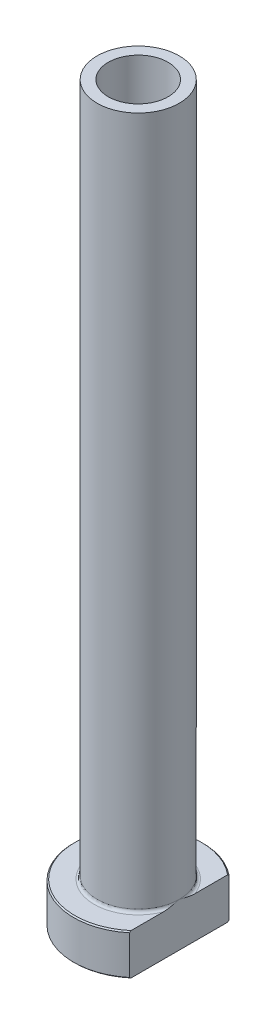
ISO-10303-21;
HEADER;
FILE_DESCRIPTION(('STEP AP214'),'2;1');
FILE_NAME('part.step','',(''),(''),'','','');
FILE_SCHEMA(('AUTOMOTIVE_DESIGN { 1 0 10303 214 1 1 1 1 }'));
ENDSEC;
DATA;
#1=APPLICATION_CONTEXT('core data for automotive mechanical design processes');
#2=APPLICATION_PROTOCOL_DEFINITION('international standard','automotive_design',2000,#1);
#3=PRODUCT_CONTEXT('',#1,'mechanical');
#4=PRODUCT('Part','Part','',(#3));
#5=PRODUCT_RELATED_PRODUCT_CATEGORY('part','',(#4));
#6=PRODUCT_DEFINITION_FORMATION('','',#4);
#7=PRODUCT_DEFINITION_CONTEXT('part definition',#1,'design');
#8=PRODUCT_DEFINITION('design','',#6,#7);
#9=PRODUCT_DEFINITION_SHAPE('','',#8);
#10=(LENGTH_UNIT() NAMED_UNIT(*) SI_UNIT(.MILLI.,.METRE.));
#11=(NAMED_UNIT(*) PLANE_ANGLE_UNIT() SI_UNIT($,.RADIAN.));
#12=(NAMED_UNIT(*) SI_UNIT($,.STERADIAN.) SOLID_ANGLE_UNIT());
#13=UNCERTAINTY_MEASURE_WITH_UNIT(LENGTH_MEASURE(1.E-05),#10,'distance_accuracy_value','');
#14=(GEOMETRIC_REPRESENTATION_CONTEXT(3) GLOBAL_UNCERTAINTY_ASSIGNED_CONTEXT((#13)) GLOBAL_UNIT_ASSIGNED_CONTEXT((#10,
#11,#12)) REPRESENTATION_CONTEXT('',''));
#15=CARTESIAN_POINT('',(0.,0.,0.));
#16=DIRECTION('',(0.,0.,1.));
#17=DIRECTION('',(1.,0.,0.));
#18=AXIS2_PLACEMENT_3D('',#15,#16,#17);
#19=CARTESIAN_POINT('',(0.,92.1876809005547,0.));
#20=DIRECTION('',(0.,1.,0.));
#21=DIRECTION('',(0.,0.,1.));
#22=AXIS2_PLACEMENT_3D('',#19,#20,#21);
#23=CYLINDRICAL_SURFACE('',#22,5.09999999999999);
#24=CARTESIAN_POINT('',(0.,125.,0.));
#25=DIRECTION('',(0.,1.,0.));
#26=DIRECTION('',(0.,0.,1.));
#27=AXIS2_PLACEMENT_3D('',#24,#25,#26);
#28=CIRCLE('',#27,5.09999999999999);
#29=CARTESIAN_POINT('',(0.,125.,5.09999999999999));
#30=VERTEX_POINT('',#29);
#31=EDGE_CURVE('E167',#30,#30,#28,.T.);
#32=ORIENTED_EDGE('',*,*,#31,.T.);
#33=EDGE_LOOP('',(#32));
#34=FACE_BOUND('',#33,.T.);
#35=CARTESIAN_POINT('',(0.,70.,0.));
#36=DIRECTION('',(0.,1.,0.));
#37=DIRECTION('',(0.,0.,1.));
#38=AXIS2_PLACEMENT_3D('',#35,#36,#37);
#39=CIRCLE('',#38,5.09999999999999);
#40=CARTESIAN_POINT('',(0.,70.,5.09999999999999));
#41=VERTEX_POINT('',#40);
#42=EDGE_CURVE('E170',#41,#41,#39,.T.);
#43=ORIENTED_EDGE('',*,*,#42,.F.);
#44=EDGE_LOOP('',(#43));
#45=FACE_BOUND('',#44,.T.);
#46=ADVANCED_FACE('F32',(#34,#45),#23,.F.);
#47=CARTESIAN_POINT('',(-5.09999999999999,125.,0.));
#48=DIRECTION('',(0.,1.,0.));
#49=DIRECTION('',(0.,0.,1.));
#50=AXIS2_PLACEMENT_3D('',#47,#48,#49);
#51=PLANE('',#50);
#52=CARTESIAN_POINT('',(0.,125.,0.));
#53=DIRECTION('',(0.,1.,0.));
#54=DIRECTION('',(0.,0.,1.));
#55=AXIS2_PLACEMENT_3D('',#52,#53,#54);
#56=CIRCLE('',#55,7.);
#57=CARTESIAN_POINT('',(0.,125.,7.));
#58=VERTEX_POINT('',#57);
#59=EDGE_CURVE('E174',#58,#58,#56,.T.);
#60=ORIENTED_EDGE('',*,*,#59,.T.);
#61=EDGE_LOOP('',(#60));
#62=FACE_BOUND('',#61,.T.);
#63=ORIENTED_EDGE('',*,*,#31,.F.);
#64=EDGE_LOOP('',(#63));
#65=FACE_BOUND('',#64,.T.);
#66=ADVANCED_FACE('F157',(#62,#65),#51,.T.);
#67=CARTESIAN_POINT('',(0.,92.1876809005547,0.));
#68=DIRECTION('',(0.,1.,0.));
#69=DIRECTION('',(0.,0.,1.));
#70=AXIS2_PLACEMENT_3D('',#67,#68,#69);
#71=CYLINDRICAL_SURFACE('',#70,7.);
#72=CARTESIAN_POINT('',(0.,7.50000000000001,0.));
#73=DIRECTION('',(0.,1.,0.));
#74=DIRECTION('',(0.,0.,1.));
#75=AXIS2_PLACEMENT_3D('',#72,#73,#74);
#76=CIRCLE('',#75,7.);
#77=CARTESIAN_POINT('',(7.,7.50000000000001,0.));
#78=VERTEX_POINT('',#77);
#79=EDGE_CURVE('E180',#78,#78,#76,.T.);
#80=ORIENTED_EDGE('',*,*,#79,.T.);
#81=EDGE_LOOP('',(#80));
#82=FACE_BOUND('',#81,.T.);
#83=ORIENTED_EDGE('',*,*,#59,.F.);
#84=EDGE_LOOP('',(#83));
#85=FACE_BOUND('',#84,.T.);
#86=ADVANCED_FACE('F162',(#82,#85),#71,.T.);
#87=CARTESIAN_POINT('',(-6.99999999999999,7.,0.));
#88=DIRECTION('',(0.,1.,0.));
#89=DIRECTION('',(0.,0.,1.));
#90=AXIS2_PLACEMENT_3D('',#87,#88,#89);
#91=PLANE('',#90);
#92=DIRECTION('',(0.,0.,1.));
#93=VECTOR('',#92,1.);
#94=CARTESIAN_POINT('',(6.99999999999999,7.,0.));
#95=LINE('',#94,#93);
#96=CARTESIAN_POINT('',(7.,7.,-8.22435407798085));
#97=VERTEX_POINT('',#96);
#98=CARTESIAN_POINT('',(6.99999999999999,7.,-2.69258240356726));
#99=VERTEX_POINT('',#98);
#100=EDGE_CURVE('E54',#97,#99,#95,.T.);
#101=ORIENTED_EDGE('',*,*,#100,.F.);
#102=CARTESIAN_POINT('',(0.,7.,0.));
#103=DIRECTION('',(0.,1.,0.));
#104=DIRECTION('',(0.,0.,1.));
#105=AXIS2_PLACEMENT_3D('',#102,#103,#104);
#106=CIRCLE('',#105,10.8);
#107=CARTESIAN_POINT('',(6.99999999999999,7.,8.22435407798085));
#108=VERTEX_POINT('',#107);
#109=EDGE_CURVE('E186',#97,#108,#106,.T.);
#110=ORIENTED_EDGE('',*,*,#109,.T.);
#111=CARTESIAN_POINT('',(6.99999999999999,7.,2.69258240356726));
#112=VERTEX_POINT('',#111);
#113=EDGE_CURVE('E134',#112,#108,#95,.T.);
#114=ORIENTED_EDGE('',*,*,#113,.F.);
#115=CARTESIAN_POINT('',(0.,7.,0.));
#116=DIRECTION('',(0.,1.,0.));
#117=DIRECTION('',(0.,0.,1.));
#118=AXIS2_PLACEMENT_3D('',#115,#116,#117);
#119=CIRCLE('',#118,7.5);
#120=EDGE_CURVE('E183',#112,#99,#119,.F.);
#121=ORIENTED_EDGE('',*,*,#120,.T.);
#122=EDGE_LOOP('',(#101,#110,#114,#121));
#123=FACE_BOUND('',#122,.T.);
#124=ADVANCED_FACE('F197',(#123),#91,.T.);
#125=CARTESIAN_POINT('',(0.,92.1876809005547,0.));
#126=DIRECTION('',(0.,1.,0.));
#127=DIRECTION('',(0.,0.,1.));
#128=AXIS2_PLACEMENT_3D('',#125,#126,#127);
#129=CYLINDRICAL_SURFACE('',#128,11.);
#130=DIRECTION('',(0.,-1.,0.));
#131=VECTOR('',#130,1.);
#132=CARTESIAN_POINT('',(6.99999999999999,125.,8.48528137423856));
#133=LINE('',#132,#131);
#134=CARTESIAN_POINT('',(6.99999999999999,6.80000000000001,8.48528137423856));
#135=VERTEX_POINT('',#134);
#136=CARTESIAN_POINT('',(6.99999999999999,0.200000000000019,8.48528137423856));
#137=VERTEX_POINT('',#136);
#138=EDGE_CURVE('E82',#135,#137,#133,.T.);
#139=ORIENTED_EDGE('',*,*,#138,.F.);
#140=CARTESIAN_POINT('',(0.,6.80000000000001,0.));
#141=DIRECTION('',(0.,1.,0.));
#142=DIRECTION('',(0.,0.,1.));
#143=AXIS2_PLACEMENT_3D('',#140,#141,#142);
#144=CIRCLE('',#143,11.);
#145=CARTESIAN_POINT('',(7.,6.80000000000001,-8.48528137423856));
#146=VERTEX_POINT('',#145);
#147=EDGE_CURVE('E95',#135,#146,#144,.F.);
#148=ORIENTED_EDGE('',*,*,#147,.T.);
#149=DIRECTION('',(0.,-1.,0.));
#150=VECTOR('',#149,1.);
#151=CARTESIAN_POINT('',(7.,125.,-8.48528137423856));
#152=LINE('',#151,#150);
#153=CARTESIAN_POINT('',(7.,0.20000000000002,-8.48528137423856));
#154=VERTEX_POINT('',#153);
#155=EDGE_CURVE('E192',#146,#154,#152,.T.);
#156=ORIENTED_EDGE('',*,*,#155,.T.);
#157=CARTESIAN_POINT('',(0.,0.20000000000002,0.));
#158=DIRECTION('',(0.,-1.,0.));
#159=DIRECTION('',(0.,0.,-1.));
#160=AXIS2_PLACEMENT_3D('',#157,#158,#159);
#161=CIRCLE('',#160,11.);
#162=EDGE_CURVE('E98',#154,#137,#161,.F.);
#163=ORIENTED_EDGE('',*,*,#162,.T.);
#164=EDGE_LOOP('',(#139,#148,#156,#163));
#165=FACE_BOUND('',#164,.T.);
#166=ADVANCED_FACE('F190',(#165),#129,.T.);
#167=CARTESIAN_POINT('',(-11.,0.,0.));
#168=DIRECTION('',(0.,-1.,0.));
#169=DIRECTION('',(0.,0.,-1.));
#170=AXIS2_PLACEMENT_3D('',#167,#168,#169);
#171=PLANE('',#170);
#172=CARTESIAN_POINT('',(0.,0.,0.));
#173=DIRECTION('',(0.,-1.,0.));
#174=DIRECTION('',(0.,0.,-1.));
#175=AXIS2_PLACEMENT_3D('',#172,#173,#174);
#176=CIRCLE('',#175,5.84999999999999);
#177=CARTESIAN_POINT('',(0.,0.,-5.84999999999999));
#178=VERTEX_POINT('',#177);
#179=EDGE_CURVE('E40',#178,#178,#176,.F.);
#180=ORIENTED_EDGE('',*,*,#179,.T.);
#181=EDGE_LOOP('',(#180));
#182=FACE_BOUND('',#181,.T.);
#183=DIRECTION('',(0.,0.,-1.));
#184=VECTOR('',#183,1.);
#185=CARTESIAN_POINT('',(6.99999999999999,0.,8.48528137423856));
#186=LINE('',#185,#184);
#187=CARTESIAN_POINT('',(6.99999999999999,0.,8.22435407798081));
#188=VERTEX_POINT('',#187);
#189=CARTESIAN_POINT('',(7.,0.,-8.22435407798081));
#190=VERTEX_POINT('',#189);
#191=EDGE_CURVE('E47',#188,#190,#186,.T.);
#192=ORIENTED_EDGE('',*,*,#191,.F.);
#193=CARTESIAN_POINT('',(0.,0.,0.));
#194=DIRECTION('',(0.,-1.,0.));
#195=DIRECTION('',(0.,0.,-1.));
#196=AXIS2_PLACEMENT_3D('',#193,#194,#195);
#197=CIRCLE('',#196,10.8);
#198=EDGE_CURVE('E92',#188,#190,#197,.T.);
#199=ORIENTED_EDGE('',*,*,#198,.T.);
#200=EDGE_LOOP('',(#192,#199));
#201=FACE_BOUND('',#200,.T.);
#202=ADVANCED_FACE('F91',(#182,#201),#171,.T.);
#203=CARTESIAN_POINT('',(0.,92.1876809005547,0.));
#204=DIRECTION('',(0.,1.,0.));
#205=DIRECTION('',(0.,0.,1.));
#206=AXIS2_PLACEMENT_3D('',#203,#204,#205);
#207=CYLINDRICAL_SURFACE('',#206,5.34999999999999);
#208=CARTESIAN_POINT('',(0.,0.5,0.));
#209=DIRECTION('',(0.,-1.,0.));
#210=DIRECTION('',(0.,0.,-1.));
#211=AXIS2_PLACEMENT_3D('',#208,#209,#210);
#212=CIRCLE('',#211,5.34999999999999);
#213=CARTESIAN_POINT('',(0.,0.5,-5.34999999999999));
#214=VERTEX_POINT('',#213);
#215=EDGE_CURVE('E11',#214,#214,#212,.T.);
#216=ORIENTED_EDGE('',*,*,#215,.T.);
#217=EDGE_LOOP('',(#216));
#218=FACE_BOUND('',#217,.T.);
#219=CARTESIAN_POINT('',(0.,58.,0.));
#220=DIRECTION('',(0.,1.,0.));
#221=DIRECTION('',(0.,0.,1.));
#222=AXIS2_PLACEMENT_3D('',#219,#220,#221);
#223=CIRCLE('',#222,5.35);
#224=CARTESIAN_POINT('',(0.,58.,5.35));
#225=VERTEX_POINT('',#224);
#226=EDGE_CURVE('E172',#225,#225,#223,.T.);
#227=ORIENTED_EDGE('',*,*,#226,.T.);
#228=EDGE_LOOP('',(#227));
#229=FACE_BOUND('',#228,.T.);
#230=ADVANCED_FACE('F215',(#218,#229),#207,.F.);
#231=CARTESIAN_POINT('',(0.,58.,0.));
#232=DIRECTION('',(0.,-1.,0.));
#233=DIRECTION('',(0.,0.,-1.));
#234=AXIS2_PLACEMENT_3D('',#231,#232,#233);
#235=CONICAL_SURFACE('',#234,5.35,0.0208303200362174);
#236=ORIENTED_EDGE('',*,*,#42,.T.);
#237=EDGE_LOOP('',(#236));
#238=FACE_BOUND('',#237,.T.);
#239=ORIENTED_EDGE('',*,*,#226,.F.);
#240=EDGE_LOOP('',(#239));
#241=FACE_BOUND('',#240,.T.);
#242=ADVANCED_FACE('F111',(#238,#241),#235,.F.);
#243=CARTESIAN_POINT('',(0.,7.50000000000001,0.));
#244=DIRECTION('',(0.,1.,0.));
#245=DIRECTION('',(0.,0.,1.));
#246=AXIS2_PLACEMENT_3D('',#243,#244,#245);
#247=TOROIDAL_SURFACE('',#246,7.5,0.5);
#248=ORIENTED_EDGE('',*,*,#120,.F.);
#249=CARTESIAN_POINT('',(7.,7.50000000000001,0.));
#250=CARTESIAN_POINT('',(7.,7.50000080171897,-1.25553870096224E-10));
#251=CARTESIAN_POINT('',(7.,7.50000160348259,2.90220272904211E-07));
#252=CARTESIAN_POINT('',(7.,7.50000310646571,1.10846441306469E-06));
#253=CARTESIAN_POINT('',(7.,7.50000379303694,1.65470112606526E-06));
#254=CARTESIAN_POINT('',(7.,7.50000521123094,2.96102753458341E-06));
#255=CARTESIAN_POINT('',(7.,7.50000592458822,3.7420417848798E-06));
#256=CARTESIAN_POINT('',(7.,7.50000721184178,5.36891875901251E-06));
#257=CARTESIAN_POINT('',(7.,7.50000778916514,6.21226347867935E-06));
#258=CARTESIAN_POINT('',(7.,7.50000990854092,9.4488970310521E-06));
#259=CARTESIAN_POINT('',(7.,7.50001133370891,1.19224913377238E-05));
#260=CARTESIAN_POINT('',(7.,7.50001370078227,1.68453048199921E-05));
#261=CARTESIAN_POINT('',(7.,7.50001467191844,1.92810862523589E-05));
#262=CARTESIAN_POINT('',(7.,7.50001870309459,2.95057524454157E-05));
#263=CARTESIAN_POINT('',(7.,7.50002167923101,3.73333819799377E-05));
#264=CARTESIAN_POINT('',(7.,7.50002610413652,5.21820411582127E-05));
#265=CARTESIAN_POINT('',(7.,7.50002771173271,5.91556013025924E-05));
#266=CARTESIAN_POINT('',(7.,7.50003935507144,0.000110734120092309));
#267=CARTESIAN_POINT('',(7.,7.50004810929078,0.000155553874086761));
#268=CARTESIAN_POINT('',(7.,7.50008643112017,0.000332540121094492));
#269=CARTESIAN_POINT('',(7.,7.50012307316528,0.000463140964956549));
#270=CARTESIAN_POINT('',(7.,7.50026565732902,0.000980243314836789));
#271=CARTESIAN_POINT('',(7.,7.50036696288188,0.00136762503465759));
#272=CARTESIAN_POINT('',(7.,7.50077257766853,0.00290683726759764));
#273=CARTESIAN_POINT('',(7.,7.50108269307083,0.00405753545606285));
#274=CARTESIAN_POINT('',(7.,7.50237341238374,0.0088598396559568));
#275=CARTESIAN_POINT('',(7.,7.50334676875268,0.0125128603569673));
#276=CARTESIAN_POINT('',(7.,7.51627189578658,0.061003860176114));
#277=CARTESIAN_POINT('',(7.,7.52827280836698,0.105832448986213));
#278=CARTESIAN_POINT('',(7.,7.55170994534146,0.193693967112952));
#279=CARTESIAN_POINT('',(7.,7.56314936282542,0.236726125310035));
#280=CARTESIAN_POINT('',(7.,7.5874041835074,0.328321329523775));
#281=CARTESIAN_POINT('',(7.,7.60020832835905,0.376887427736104));
#282=CARTESIAN_POINT('',(7.,7.62578161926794,0.474605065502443));
#283=CARTESIAN_POINT('',(7.,7.63854879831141,0.523757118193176));
#284=CARTESIAN_POINT('',(7.,7.66904753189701,0.642366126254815));
#285=CARTESIAN_POINT('',(7.,7.6866596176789,0.711854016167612));
#286=CARTESIAN_POINT('',(7.,7.72074501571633,0.849103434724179));
#287=CARTESIAN_POINT('',(7.,7.73723627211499,0.916860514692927));
#288=CARTESIAN_POINT('',(7.,7.79038156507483,1.14104210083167));
#289=CARTESIAN_POINT('',(7.,7.82528973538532,1.29788860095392));
#290=CARTESIAN_POINT('',(7.,7.88862298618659,1.61471917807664));
#291=CARTESIAN_POINT('',(7.,7.91697354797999,1.77471883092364));
#292=CARTESIAN_POINT('',(7.,7.95258292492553,2.02253505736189));
#293=CARTESIAN_POINT('',(7.,7.96355251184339,2.10981398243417));
#294=CARTESIAN_POINT('',(7.,7.98165287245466,2.28476193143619));
#295=CARTESIAN_POINT('',(7.,7.98878459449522,2.37243085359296));
#296=CARTESIAN_POINT('',(7.,7.99822919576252,2.54760327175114));
#297=CARTESIAN_POINT('',(7.,8.00056589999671,2.63510541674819));
#298=CARTESIAN_POINT('',(7.,7.99919996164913,2.81004074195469));
#299=CARTESIAN_POINT('',(7.,7.99550272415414,2.89747391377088));
#300=CARTESIAN_POINT('',(7.,7.98391011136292,3.0288207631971));
#301=CARTESIAN_POINT('',(7.,7.97897237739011,3.07299684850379));
#302=CARTESIAN_POINT('',(7.,7.96665453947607,3.16105400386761));
#303=CARTESIAN_POINT('',(7.,7.95927246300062,3.20493480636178));
#304=CARTESIAN_POINT('',(7.,7.94168688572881,3.29163191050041));
#305=CARTESIAN_POINT('',(7.,7.93151559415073,3.33445462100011));
#306=CARTESIAN_POINT('',(7.,7.90768392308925,3.41909658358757));
#307=CARTESIAN_POINT('',(7.,7.89402748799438,3.46091691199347));
#308=CARTESIAN_POINT('',(7.,7.86214701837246,3.54331777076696));
#309=CARTESIAN_POINT('',(7.,7.84387618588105,3.58388050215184));
#310=CARTESIAN_POINT('',(7.,7.80145892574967,3.66184445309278));
#311=CARTESIAN_POINT('',(7.,7.7773356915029,3.69925738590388));
#312=CARTESIAN_POINT('',(7.,7.73714014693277,3.74836513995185));
#313=CARTESIAN_POINT('',(7.,7.72423208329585,3.7626369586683));
#314=CARTESIAN_POINT('',(7.,7.69673765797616,3.78951670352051));
#315=CARTESIAN_POINT('',(7.,7.68215013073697,3.80212346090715));
#316=CARTESIAN_POINT('',(7.,7.65099843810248,3.82514624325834));
#317=CARTESIAN_POINT('',(7.,7.63441049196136,3.83553078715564));
#318=CARTESIAN_POINT('',(7.,7.5995579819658,3.85294010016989));
#319=CARTESIAN_POINT('',(7.,7.58129885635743,3.85997533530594));
#320=CARTESIAN_POINT('',(7.,7.54906837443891,3.86837810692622));
#321=CARTESIAN_POINT('',(7.,7.53536870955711,3.8707923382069));
#322=CARTESIAN_POINT('',(7.,7.50775756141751,3.87325240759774));
#323=CARTESIAN_POINT('',(7.,7.49384618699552,3.87329942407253));
#324=CARTESIAN_POINT('',(7.,7.46623771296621,3.87102093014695));
#325=CARTESIAN_POINT('',(7.,7.45254041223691,3.8686978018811));
#326=CARTESIAN_POINT('',(7.,7.42569741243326,3.86188775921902));
#327=CARTESIAN_POINT('',(7.,7.41255212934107,3.85739924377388));
#328=CARTESIAN_POINT('',(7.,7.38259319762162,3.84468786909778));
#329=CARTESIAN_POINT('',(7.,7.3661021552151,3.83570823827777));
#330=CARTESIAN_POINT('',(7.,7.33476729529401,3.81523202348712));
#331=CARTESIAN_POINT('',(7.,7.31992737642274,3.80372966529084));
#332=CARTESIAN_POINT('',(7.,7.28371925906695,3.77170797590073));
#333=CARTESIAN_POINT('',(7.,7.26356272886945,3.74983059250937));
#334=CARTESIAN_POINT('',(7.,7.22671696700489,3.70338283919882));
#335=CARTESIAN_POINT('',(7.,7.21003361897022,3.67880800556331));
#336=CARTESIAN_POINT('',(7.,7.1802655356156,3.62921731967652));
#337=CARTESIAN_POINT('',(7.,7.16704475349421,3.60428175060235));
#338=CARTESIAN_POINT('',(7.,7.14275069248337,3.55337478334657));
#339=CARTESIAN_POINT('',(7.,7.13167947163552,3.52740242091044));
#340=CARTESIAN_POINT('',(7.,7.10104499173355,3.44809573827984));
#341=CARTESIAN_POINT('',(7.,7.08424174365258,3.39369851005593));
#342=CARTESIAN_POINT('',(7.,7.05431378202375,3.27667221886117));
#343=CARTESIAN_POINT('',(7.,7.0419171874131,3.21386807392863));
#344=CARTESIAN_POINT('',(7.,7.0223460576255,3.08735184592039));
#345=CARTESIAN_POINT('',(7.,7.01518234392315,3.02363815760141));
#346=CARTESIAN_POINT('',(7.,7.00517826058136,2.89779001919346));
#347=CARTESIAN_POINT('',(7.,7.00221627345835,2.83566460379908));
#348=CARTESIAN_POINT('',(7.,6.99952325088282,2.7116062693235));
#349=CARTESIAN_POINT('',(7.,6.99977918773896,2.6496735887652));
#350=CARTESIAN_POINT('',(7.,7.00377761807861,2.49407814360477));
#351=CARTESIAN_POINT('',(7.,7.00924384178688,2.40046113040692));
#352=CARTESIAN_POINT('',(7.,7.0249410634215,2.21367396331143));
#353=CARTESIAN_POINT('',(7.,7.03517106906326,2.12050372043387));
#354=CARTESIAN_POINT('',(7.,7.05969765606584,1.93249035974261));
#355=CARTESIAN_POINT('',(7.,7.07408383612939,1.8376591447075));
#356=CARTESIAN_POINT('',(7.,7.10603300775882,1.6482934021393));
#357=CARTESIAN_POINT('',(7.,7.12360402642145,1.55376025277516));
#358=CARTESIAN_POINT('',(7.,7.16806468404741,1.33086107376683));
#359=CARTESIAN_POINT('',(7.,7.1960178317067,1.20270896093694));
#360=CARTESIAN_POINT('',(7.,7.25475947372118,0.948586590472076));
#361=CARTESIAN_POINT('',(7.,7.28551257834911,0.82260799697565));
#362=CARTESIAN_POINT('',(7.,7.33123897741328,0.641334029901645));
#363=CARTESIAN_POINT('',(7.,7.34543722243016,0.58584061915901));
#364=CARTESIAN_POINT('',(7.,7.37418243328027,0.474686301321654));
#365=CARTESIAN_POINT('',(7.,7.38873064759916,0.419025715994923));
#366=CARTESIAN_POINT('',(7.,7.41873357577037,0.305011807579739));
#367=CARTESIAN_POINT('',(7.,7.43419762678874,0.246660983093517));
#368=CARTESIAN_POINT('',(7.,7.46502361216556,0.130933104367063));
#369=CARTESIAN_POINT('',(7.,7.48038319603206,0.0735554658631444));
#370=CARTESIAN_POINT('',(7.,7.49665455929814,0.0125077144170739));
#371=CARTESIAN_POINT('',(7.,7.49762931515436,0.00884956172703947));
#372=CARTESIAN_POINT('',(7.,7.49892036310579,0.0040460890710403));
#373=CARTESIAN_POINT('',(7.,7.49922940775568,0.00289935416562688));
#374=CARTESIAN_POINT('',(7.,7.49963371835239,0.00136508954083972));
#375=CARTESIAN_POINT('',(7.,7.499734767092,0.000978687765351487));
#376=CARTESIAN_POINT('',(7.,7.49987704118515,0.00046273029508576));
#377=CARTESIAN_POINT('',(7.,7.49991363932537,0.000332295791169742));
#378=CARTESIAN_POINT('',(7.,7.49995192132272,0.000155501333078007));
#379=CARTESIAN_POINT('',(7.,7.49996067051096,0.000110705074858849));
#380=CARTESIAN_POINT('',(7.,7.49997230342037,5.91504855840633E-05));
#381=CARTESIAN_POINT('',(7.,7.49997390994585,5.21782459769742E-05));
#382=CARTESIAN_POINT('',(7.,7.4999783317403,3.73322807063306E-05));
#383=CARTESIAN_POINT('',(7.,7.4999813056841,2.95059544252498E-05));
#384=CARTESIAN_POINT('',(7.,7.49998533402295,1.92826350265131E-05));
#385=CARTESIAN_POINT('',(7.,7.49998630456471,1.68469523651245E-05));
#386=CARTESIAN_POINT('',(7.,7.49998867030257,1.19242372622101E-05));
#387=CARTESIAN_POINT('',(7.,7.49999009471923,9.45063049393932E-06));
#388=CARTESIAN_POINT('',(7.,7.49999221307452,6.21386443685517E-06));
#389=CARTESIAN_POINT('',(7.,7.49999279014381,5.37045304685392E-06));
#390=CARTESIAN_POINT('',(7.,7.49999407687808,3.74339687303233E-06));
#391=CARTESIAN_POINT('',(7.,7.49999478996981,2.96226854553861E-06));
#392=CARTESIAN_POINT('',(7.,7.49999620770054,1.65567341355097E-06));
#393=CARTESIAN_POINT('',(7.,7.49999689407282,1.10929189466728E-06));
#394=CARTESIAN_POINT('',(7.,7.49999839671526,2.9068315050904E-07));
#395=CARTESIAN_POINT('',(7.,7.49999919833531,1.25546802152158E-10));
#396=CARTESIAN_POINT('',(7.,7.50000000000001,0.));
#397=B_SPLINE_CURVE_WITH_KNOTS('',3,(#249,#250,#251,#252,#253,#254,#255,#256,#257,#258,#259,
#260,#261,#262,#263,#264,#265,#266,#267,#268,#269,#270,#271,#272,#273,#274,#275,#276,#277,#278,
#279,#280,#281,#282,#283,#284,#285,#286,#287,#288,#289,#290,#291,#292,#293,#294,#295,#296,#297,
#298,#299,#300,#301,#302,#303,#304,#305,#306,#307,#308,#309,#310,#311,#312,#313,#314,#315,#316,
#317,#318,#319,#320,#321,#322,#323,#324,#325,#326,#327,#328,#329,#330,#331,#332,#333,#334,#335,
#336,#337,#338,#339,#340,#341,#342,#343,#344,#345,#346,#347,#348,#349,#350,#351,#352,#353,#354,
#355,#356,#357,#358,#359,#360,#361,#362,#363,#364,#365,#366,#367,#368,#369,#370,#371,#372,#373,
#374,#375,#376,#377,#378,#379,#380,#381,#382,#383,#384,#385,#386,#387,#388,#389,#390,#391,#392,
#393,#394,#395,#396),.UNSPECIFIED.,.T.,.F.,(4,2,2,2,2,2,2,2,2,2,2,2,2,2,2,2,2,2,2,2,2,2,2,2,2,2,
2,2,2,2,2,2,2,2,2,2,2,2,2,2,2,2,2,2,2,2,2,2,2,2,2,2,2,2,2,2,2,2,2,2,2,2,2,2,2,2,2,2,2,2,2,2,2,
4),(0.,2.42201439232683E-06,5.0530489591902E-06,8.20814149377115E-06,1.12722937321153E-05,
1.98044023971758E-05,2.76642073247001E-05,5.27403854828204E-05,7.41830797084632E-05,
0.000211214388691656,0.000617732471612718,0.00181938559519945,0.00539412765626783,
0.0167361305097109,0.155952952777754,0.289534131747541,0.440210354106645,0.592559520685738,
0.80761174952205,1.01681499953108,1.49878389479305,1.98598665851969,2.24981935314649,
2.51358682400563,2.77604050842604,3.03825922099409,3.17156039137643,3.30496939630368,
3.43689837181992,3.56867869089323,3.70185328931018,3.83450849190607,3.89212877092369,
3.94978928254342,4.00821928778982,4.06646549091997,4.10801107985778,4.14953598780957,
4.19101920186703,4.23253313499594,4.28854866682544,4.34469377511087,4.43343413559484,
4.52232362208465,4.60686785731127,4.69149264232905,4.86185145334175,5.05362927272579,
5.24580256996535,5.43229132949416,5.6180253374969,5.89918385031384,6.18028382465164,
6.46796485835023,6.75638131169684,7.14981284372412,7.53882346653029,7.71066604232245,
7.88325629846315,8.06435328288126,8.24254095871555,8.25389891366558,8.25746134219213,
8.25865995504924,8.25906595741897,8.25920291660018,8.2592243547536,8.25924942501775,
8.25925728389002,8.25926581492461,8.25926887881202,8.25927203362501,8.25927466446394,
8.25927708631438),.UNSPECIFIED.);
#398=EDGE_CURVE('E126',#112,#78,#397,.T.);
#399=ORIENTED_EDGE('',*,*,#398,.T.);
#400=ORIENTED_EDGE('',*,*,#79,.F.);
#401=CARTESIAN_POINT('',(7.,7.50000000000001,0.));
#402=CARTESIAN_POINT('',(7.,7.49999919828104,1.25555284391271E-10));
#403=CARTESIAN_POINT('',(7.,7.49999839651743,-2.90220271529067E-07));
#404=CARTESIAN_POINT('',(7.,7.4999968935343,-1.10846441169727E-06));
#405=CARTESIAN_POINT('',(7.,7.49999620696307,-1.65470112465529E-06));
#406=CARTESIAN_POINT('',(7.,7.49999478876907,-2.96102753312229E-06));
#407=CARTESIAN_POINT('',(7.,7.49999407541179,-3.74204178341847E-06));
#408=CARTESIAN_POINT('',(7.,7.49999278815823,-5.36891875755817E-06));
#409=CARTESIAN_POINT('',(7.,7.49999221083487,-6.21226347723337E-06));
#410=CARTESIAN_POINT('',(7.,7.49999009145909,-9.44889702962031E-06));
#411=CARTESIAN_POINT('',(7.,7.49998866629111,-1.19224913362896E-05));
#412=CARTESIAN_POINT('',(7.,7.49998629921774,-1.68453048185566E-05));
#413=CARTESIAN_POINT('',(7.,7.49998532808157,-1.92810862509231E-05));
#414=CARTESIAN_POINT('',(7.,7.49998129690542,-2.95057524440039E-05));
#415=CARTESIAN_POINT('',(6.99999999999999,7.499978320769,-3.73333819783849E-05));
#416=CARTESIAN_POINT('',(6.99999999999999,7.49997389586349,-5.21820411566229E-05));
#417=CARTESIAN_POINT('',(6.99999999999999,7.49997228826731,-5.91556013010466E-05));
#418=CARTESIAN_POINT('',(7.,7.49996064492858,-0.000110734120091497));
#419=CARTESIAN_POINT('',(7.,7.49995189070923,-0.000155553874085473));
#420=CARTESIAN_POINT('',(6.99999999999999,7.49991356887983,-0.000332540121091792));
#421=CARTESIAN_POINT('',(6.99999999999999,7.49987692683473,-0.000463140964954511));
#422=CARTESIAN_POINT('',(7.,7.499734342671,-0.000980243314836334));
#423=CARTESIAN_POINT('',(7.,7.49963303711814,-0.00136762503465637));
#424=CARTESIAN_POINT('',(6.99999999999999,7.49922742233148,-0.00290683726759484));
#425=CARTESIAN_POINT('',(6.99999999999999,7.49891730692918,-0.00405753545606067));
#426=CARTESIAN_POINT('',(7.00000000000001,7.49762658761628,-0.00885983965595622));
#427=CARTESIAN_POINT('',(7.,7.49665323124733,-0.0125128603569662));
#428=CARTESIAN_POINT('',(6.99999999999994,7.48372810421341,-0.0610038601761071));
#429=CARTESIAN_POINT('',(6.99999999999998,7.47172719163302,-0.10583244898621));
#430=CARTESIAN_POINT('',(7.00000000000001,7.44829005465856,-0.193693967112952));
#431=CARTESIAN_POINT('',(7.,7.43685063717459,-0.236726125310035));
#432=CARTESIAN_POINT('',(6.99999999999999,7.41259581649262,-0.328321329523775));
#433=CARTESIAN_POINT('',(6.99999999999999,7.39979167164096,-0.376887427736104));
#434=CARTESIAN_POINT('',(7.,7.37421838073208,-0.474605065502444));
#435=CARTESIAN_POINT('',(7.,7.36145120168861,-0.523757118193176));
#436=CARTESIAN_POINT('',(6.99999999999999,7.330952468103,-0.642366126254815));
#437=CARTESIAN_POINT('',(7.,7.31334038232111,-0.711854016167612));
#438=CARTESIAN_POINT('',(7.,7.27925498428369,-0.849103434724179));
#439=CARTESIAN_POINT('',(7.,7.26276372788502,-0.916860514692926));
#440=CARTESIAN_POINT('',(7.,7.20961843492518,-1.14104210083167));
#441=CARTESIAN_POINT('',(7.,7.17471026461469,-1.29788860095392));
#442=CARTESIAN_POINT('',(7.,7.11137701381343,-1.61471917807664));
#443=CARTESIAN_POINT('',(7.,7.08302645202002,-1.77471883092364));
#444=CARTESIAN_POINT('',(7.,7.04741707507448,-2.02253505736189));
#445=CARTESIAN_POINT('',(7.,7.03644748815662,-2.10981398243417));
#446=CARTESIAN_POINT('',(7.,7.01834712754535,-2.28476193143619));
#447=CARTESIAN_POINT('',(7.,7.01121540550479,-2.37243085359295));
#448=CARTESIAN_POINT('',(7.,7.0017708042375,-2.54760327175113));
#449=CARTESIAN_POINT('',(7.,6.99943410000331,-2.63510541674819));
#450=CARTESIAN_POINT('',(7.,7.00080003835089,-2.81004074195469));
#451=CARTESIAN_POINT('',(7.,7.00449727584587,-2.89747391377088));
#452=CARTESIAN_POINT('',(7.,7.0160898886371,-3.0288207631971));
#453=CARTESIAN_POINT('',(7.,7.0210276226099,-3.07299684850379));
#454=CARTESIAN_POINT('',(7.,7.03334546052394,-3.16105400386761));
#455=CARTESIAN_POINT('',(7.,7.0407275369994,-3.20493480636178));
#456=CARTESIAN_POINT('',(7.,7.0583131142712,-3.29163191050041));
#457=CARTESIAN_POINT('',(7.,7.06848440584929,-3.33445462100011));
#458=CARTESIAN_POINT('',(7.,7.09231607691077,-3.41909658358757));
#459=CARTESIAN_POINT('',(7.,7.10597251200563,-3.46091691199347));
#460=CARTESIAN_POINT('',(7.,7.13785298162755,-3.54331777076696));
#461=CARTESIAN_POINT('',(7.,7.15612381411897,-3.58388050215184));
#462=CARTESIAN_POINT('',(7.,7.19854107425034,-3.66184445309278));
#463=CARTESIAN_POINT('',(7.,7.22266430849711,-3.69925738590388));
#464=CARTESIAN_POINT('',(7.,7.26285985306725,-3.74836513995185));
#465=CARTESIAN_POINT('',(7.,7.27576791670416,-3.76263695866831));
#466=CARTESIAN_POINT('',(7.,7.30326234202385,-3.78951670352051));
#467=CARTESIAN_POINT('',(7.,7.31784986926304,-3.80212346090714));
#468=CARTESIAN_POINT('',(7.,7.34900156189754,-3.82514624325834));
#469=CARTESIAN_POINT('',(7.,7.36558950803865,-3.83553078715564));
#470=CARTESIAN_POINT('',(7.,7.40044201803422,-3.85294010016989));
#471=CARTESIAN_POINT('',(7.,7.41870114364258,-3.85997533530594));
#472=CARTESIAN_POINT('',(7.,7.45093162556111,-3.86837810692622));
#473=CARTESIAN_POINT('',(7.,7.4646312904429,-3.8707923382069));
#474=CARTESIAN_POINT('',(7.,7.49224243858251,-3.87325240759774));
#475=CARTESIAN_POINT('',(7.,7.5061538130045,-3.87329942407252));
#476=CARTESIAN_POINT('',(7.,7.5337622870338,-3.87102093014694));
#477=CARTESIAN_POINT('',(7.,7.5474595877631,-3.8686978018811));
#478=CARTESIAN_POINT('',(7.,7.57430258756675,-3.86188775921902));
#479=CARTESIAN_POINT('',(7.,7.58744787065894,-3.85739924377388));
#480=CARTESIAN_POINT('',(7.,7.61740680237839,-3.84468786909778));
#481=CARTESIAN_POINT('',(7.,7.63389784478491,-3.83570823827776));
#482=CARTESIAN_POINT('',(7.,7.665232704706,-3.81523202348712));
#483=CARTESIAN_POINT('',(7.,7.68007262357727,-3.80372966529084));
#484=CARTESIAN_POINT('',(7.,7.71628074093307,-3.77170797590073));
#485=CARTESIAN_POINT('',(7.,7.73643727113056,-3.74983059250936));
#486=CARTESIAN_POINT('',(7.,7.77328303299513,-3.70338283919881));
#487=CARTESIAN_POINT('',(7.,7.78996638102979,-3.67880800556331));
#488=CARTESIAN_POINT('',(7.,7.81973446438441,-3.62921731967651));
#489=CARTESIAN_POINT('',(7.,7.8329552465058,-3.60428175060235));
#490=CARTESIAN_POINT('',(7.,7.85724930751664,-3.55337478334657));
#491=CARTESIAN_POINT('',(7.,7.86832052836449,-3.52740242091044));
#492=CARTESIAN_POINT('',(7.,7.89895500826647,-3.44809573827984));
#493=CARTESIAN_POINT('',(7.,7.91575825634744,-3.39369851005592));
#494=CARTESIAN_POINT('',(7.,7.94568621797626,-3.27667221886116));
#495=CARTESIAN_POINT('',(7.,7.95808281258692,-3.21386807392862));
#496=CARTESIAN_POINT('',(7.,7.97765394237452,-3.08735184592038));
#497=CARTESIAN_POINT('',(7.,7.98481765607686,-3.0236381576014));
#498=CARTESIAN_POINT('',(7.,7.99482173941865,-2.89779001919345));
#499=CARTESIAN_POINT('',(7.,7.99778372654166,-2.83566460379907));
#500=CARTESIAN_POINT('',(7.,8.00047674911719,-2.71160626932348));
#501=CARTESIAN_POINT('',(7.,8.00022081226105,-2.64967358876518));
#502=CARTESIAN_POINT('',(7.,7.9962223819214,-2.49407814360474));
#503=CARTESIAN_POINT('',(7.,7.99075615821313,-2.4004611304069));
#504=CARTESIAN_POINT('',(7.,7.97505893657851,-2.21367396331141));
#505=CARTESIAN_POINT('',(7.,7.96482893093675,-2.12050372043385));
#506=CARTESIAN_POINT('',(7.,7.94030234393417,-1.93249035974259));
#507=CARTESIAN_POINT('',(7.,7.92591616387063,-1.83765914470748));
#508=CARTESIAN_POINT('',(7.,7.89396699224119,-1.64829340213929));
#509=CARTESIAN_POINT('',(7.,7.87639597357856,-1.55376025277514));
#510=CARTESIAN_POINT('',(7.,7.83193531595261,-1.33086107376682));
#511=CARTESIAN_POINT('',(7.,7.80398216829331,-1.20270896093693));
#512=CARTESIAN_POINT('',(7.,7.74524052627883,-0.94858659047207));
#513=CARTESIAN_POINT('',(7.,7.71448742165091,-0.822607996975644));
#514=CARTESIAN_POINT('',(7.,7.66876102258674,-0.641334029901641));
#515=CARTESIAN_POINT('',(7.,7.65456277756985,-0.585840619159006));
#516=CARTESIAN_POINT('',(7.,7.62581756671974,-0.474686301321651));
#517=CARTESIAN_POINT('',(7.,7.61126935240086,-0.41902571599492));
#518=CARTESIAN_POINT('',(7.,7.58126642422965,-0.305011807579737));
#519=CARTESIAN_POINT('',(7.,7.56580237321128,-0.246660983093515));
#520=CARTESIAN_POINT('',(7.,7.53497638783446,-0.130933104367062));
#521=CARTESIAN_POINT('',(7.,7.51961680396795,-0.0735554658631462));
#522=CARTESIAN_POINT('',(7.,7.50334544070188,-0.0125077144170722));
#523=CARTESIAN_POINT('',(7.,7.50237068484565,-0.00884956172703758));
#524=CARTESIAN_POINT('',(7.,7.50107963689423,-0.00404608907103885));
#525=CARTESIAN_POINT('',(7.,7.50077059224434,-0.00289935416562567));
#526=CARTESIAN_POINT('',(7.,7.50036628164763,-0.0013650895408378));
#527=CARTESIAN_POINT('',(7.,7.50026523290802,-0.000978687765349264));
#528=CARTESIAN_POINT('',(7.,7.50012295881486,-0.000462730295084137));
#529=CARTESIAN_POINT('',(7.,7.50008636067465,-0.000332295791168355));
#530=CARTESIAN_POINT('',(7.,7.50004807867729,-0.000155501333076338));
#531=CARTESIAN_POINT('',(7.,7.50003932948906,-0.000110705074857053));
#532=CARTESIAN_POINT('',(7.,7.50002769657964,-5.91504855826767E-05));
#533=CARTESIAN_POINT('',(7.,7.50002609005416,-5.2178245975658E-05));
#534=CARTESIAN_POINT('',(7.,7.50002166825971,-3.7332280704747E-05));
#535=CARTESIAN_POINT('',(7.,7.50001869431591,-2.95059544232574E-05));
#536=CARTESIAN_POINT('',(7.,7.50001466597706,-1.92826350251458E-05));
#537=CARTESIAN_POINT('',(7.,7.5000136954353,-1.68469523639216E-05));
#538=CARTESIAN_POINT('',(7.,7.50001132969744,-1.1924237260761E-05));
#539=CARTESIAN_POINT('',(7.,7.50000990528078,-9.45063049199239E-06));
#540=CARTESIAN_POINT('',(7.,7.50000778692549,-6.21386443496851E-06));
#541=CARTESIAN_POINT('',(7.,7.5000072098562,-5.37045304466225E-06));
#542=CARTESIAN_POINT('',(7.,7.50000592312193,-3.74339687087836E-06));
#543=CARTESIAN_POINT('',(6.99999999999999,7.5000052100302,-2.96226854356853E-06));
#544=CARTESIAN_POINT('',(7.,7.50000379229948,-1.65567341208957E-06));
#545=CARTESIAN_POINT('',(7.,7.50000310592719,-1.10929189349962E-06));
#546=CARTESIAN_POINT('',(7.,7.50000160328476,-2.90683149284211E-07));
#547=CARTESIAN_POINT('',(7.,7.5000008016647,-1.25545354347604E-10));
#548=CARTESIAN_POINT('',(7.,7.50000000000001,0.));
#549=B_SPLINE_CURVE_WITH_KNOTS('',3,(#401,#402,#403,#404,#405,#406,#407,#408,#409,#410,#411,
#412,#413,#414,#415,#416,#417,#418,#419,#420,#421,#422,#423,#424,#425,#426,#427,#428,#429,#430,
#431,#432,#433,#434,#435,#436,#437,#438,#439,#440,#441,#442,#443,#444,#445,#446,#447,#448,#449,
#450,#451,#452,#453,#454,#455,#456,#457,#458,#459,#460,#461,#462,#463,#464,#465,#466,#467,#468,
#469,#470,#471,#472,#473,#474,#475,#476,#477,#478,#479,#480,#481,#482,#483,#484,#485,#486,#487,
#488,#489,#490,#491,#492,#493,#494,#495,#496,#497,#498,#499,#500,#501,#502,#503,#504,#505,#506,
#507,#508,#509,#510,#511,#512,#513,#514,#515,#516,#517,#518,#519,#520,#521,#522,#523,#524,#525,
#526,#527,#528,#529,#530,#531,#532,#533,#534,#535,#536,#537,#538,#539,#540,#541,#542,#543,#544,
#545,#546,#547,#548),.UNSPECIFIED.,.T.,.F.,(4,2,2,2,2,2,2,2,2,2,2,2,2,2,2,2,2,2,2,2,2,2,2,2,2,2,
2,2,2,2,2,2,2,2,2,2,2,2,2,2,2,2,2,2,2,2,2,2,2,2,2,2,2,2,2,2,2,2,2,2,2,2,2,2,2,2,2,2,2,2,2,2,2,
4),(0.,2.42201439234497E-06,5.05304895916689E-06,8.20814149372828E-06,1.12722937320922E-05,
1.98044023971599E-05,2.76642073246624E-05,5.27403854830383E-05,7.41830797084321E-05,
0.000211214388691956,0.000617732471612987,0.00181938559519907,0.00539412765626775,
0.0167361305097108,0.155952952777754,0.289534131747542,0.440210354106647,0.59255952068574,
0.807611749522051,1.01681499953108,1.49878389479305,1.98598665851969,2.24981935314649,
2.51358682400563,2.77604050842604,3.0382592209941,3.17156039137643,3.30496939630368,
3.43689837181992,3.56867869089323,3.70185328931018,3.83450849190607,3.89212877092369,
3.94978928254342,4.00821928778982,4.06646549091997,4.10801107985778,4.14953598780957,
4.19101920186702,4.23253313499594,4.28854866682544,4.34469377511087,4.43343413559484,
4.52232362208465,4.60686785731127,4.69149264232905,4.86185145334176,5.0536292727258,
5.24580256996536,5.43229132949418,5.61802533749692,5.89918385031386,6.18028382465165,
6.46796485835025,6.75638131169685,7.14981284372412,7.5388234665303,7.71066604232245,
7.88325629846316,8.06435328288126,8.24254095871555,8.25389891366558,8.25746134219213,
8.25865995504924,8.25906595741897,8.25920291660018,8.2592243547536,8.25924942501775,
8.25925728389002,8.25926581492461,8.25926887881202,8.25927203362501,8.25927466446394,
8.25927708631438),.UNSPECIFIED.);
#550=EDGE_CURVE('E135',#78,#99,#549,.T.);
#551=ORIENTED_EDGE('',*,*,#550,.T.);
#552=EDGE_LOOP('',(#248,#399,#400,#551));
#553=FACE_BOUND('',#552,.T.);
#554=ADVANCED_FACE('F141',(#553),#247,.F.);
#555=CARTESIAN_POINT('',(0.,7.00000000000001,0.));
#556=DIRECTION('',(0.,-1.,0.));
#557=DIRECTION('',(0.,0.,-1.));
#558=AXIS2_PLACEMENT_3D('',#555,#556,#557);
#559=CONICAL_SURFACE('',#558,10.8,0.785398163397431);
#560=CARTESIAN_POINT('',(7.,-2.13774979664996,-18.6685261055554));
#561=CARTESIAN_POINT('',(7.,-1.86574872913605,-18.3780244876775));
#562=CARTESIAN_POINT('',(7.,-1.59415659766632,-18.0871392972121));
#563=CARTESIAN_POINT('',(7.,-1.0519287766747,-17.5044755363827));
#564=CARTESIAN_POINT('',(7.,-0.781293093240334,-17.2126969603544));
#565=CARTESIAN_POINT('',(7.,-0.241050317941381,-16.628048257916));
#566=CARTESIAN_POINT('',(7.,0.0285564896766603,-16.3351778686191));
#567=CARTESIAN_POINT('',(7.,0.566485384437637,-15.7482616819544));
#568=CARTESIAN_POINT('',(7.,0.834807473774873,-15.4542158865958));
#569=CARTESIAN_POINT('',(7.,1.64198377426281,-14.5651645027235));
#570=CARTESIAN_POINT('',(7.,2.17856420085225,-13.9680841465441));
#571=CARTESIAN_POINT('',(7.,2.97696333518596,-13.0668144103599));
#572=CARTESIAN_POINT('',(7.,3.24199785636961,-12.7654727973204));
#573=CARTESIAN_POINT('',(7.,3.76945856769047,-12.1605141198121));
#574=CARTESIAN_POINT('',(7.,4.03188476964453,-11.856897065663));
#575=CARTESIAN_POINT('',(7.,4.50733797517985,-11.3009625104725));
#576=CARTESIAN_POINT('',(7.,4.72088020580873,-11.0490858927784));
#577=CARTESIAN_POINT('',(7.,5.14538078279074,-10.5431655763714));
#578=CARTESIAN_POINT('',(7.,5.3563391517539,-10.2891218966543));
#579=CARTESIAN_POINT('',(7.,5.77522964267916,-9.77836737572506));
#580=CARTESIAN_POINT('',(7.,5.98316044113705,-9.5216554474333));
#581=CARTESIAN_POINT('',(7.,6.39521098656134,-9.00519084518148));
#582=CARTESIAN_POINT('',(7.,6.59933078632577,-8.74543821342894));
#583=CARTESIAN_POINT('',(7.,7.00243445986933,-8.22283607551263));
#584=CARTESIAN_POINT('',(7.,7.20142819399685,-7.95999419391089));
#585=CARTESIAN_POINT('',(7.,7.59353840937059,-7.42991856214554));
#586=CARTESIAN_POINT('',(7.,7.78665447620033,-7.16268450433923));
#587=CARTESIAN_POINT('',(7.,8.16523718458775,-6.62311113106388));
#588=CARTESIAN_POINT('',(7.,8.3507091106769,-6.35077553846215));
#589=CARTESIAN_POINT('',(7.,8.71189725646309,-5.79973731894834));
#590=CARTESIAN_POINT('',(7.,8.88761537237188,-5.52103594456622));
#591=CARTESIAN_POINT('',(7.,9.19554959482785,-5.00707921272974));
#592=CARTESIAN_POINT('',(7.,9.32988075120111,-4.77309669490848));
#593=CARTESIAN_POINT('',(7.,9.58764253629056,-4.29911523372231));
#594=CARTESIAN_POINT('',(7.,9.71107181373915,-4.05911554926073));
#595=CARTESIAN_POINT('',(7.,9.94390907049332,-3.57263619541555));
#596=CARTESIAN_POINT('',(7.,10.0533307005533,-3.32616312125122));
#597=CARTESIAN_POINT('',(7.,10.2545146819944,-2.82607166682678));
#598=CARTESIAN_POINT('',(7.,10.3462820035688,-2.57245532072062));
#599=CARTESIAN_POINT('',(7.,10.4907049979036,-2.11254447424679));
#600=CARTESIAN_POINT('',(7.,10.5475277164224,-1.90756611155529));
#601=CARTESIAN_POINT('',(7.,10.6452043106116,-1.49381161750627));
#602=CARTESIAN_POINT('',(7.,10.68606033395,-1.28503600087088));
#603=CARTESIAN_POINT('',(7.,10.749755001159,-0.865342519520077));
#604=CARTESIAN_POINT('',(7.,10.772646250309,-0.654432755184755));
#605=CARTESIAN_POINT('',(7.,10.7993569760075,-0.231396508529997));
#606=CARTESIAN_POINT('',(7.,10.8031771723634,-0.0192700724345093));
#607=CARTESIAN_POINT('',(7.,10.791517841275,0.404715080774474));
#608=CARTESIAN_POINT('',(7.,10.7760135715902,0.616573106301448));
#609=CARTESIAN_POINT('',(7.,10.726541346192,1.03810446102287));
#610=CARTESIAN_POINT('',(7.,10.692571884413,1.24777761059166));
#611=CARTESIAN_POINT('',(7.,10.6077703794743,1.66430273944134));
#612=CARTESIAN_POINT('',(7.,10.5568873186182,1.87114418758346));
#613=CARTESIAN_POINT('',(7.,10.4404729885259,2.2806127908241));
#614=CARTESIAN_POINT('',(7.,10.3749414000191,2.48323985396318));
#615=CARTESIAN_POINT('',(7.,10.2190980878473,2.91860265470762));
#616=CARTESIAN_POINT('',(7.,10.126461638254,3.15050038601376));
#617=CARTESIAN_POINT('',(7.,9.92740958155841,3.6083545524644));
#618=CARTESIAN_POINT('',(7.,9.82098769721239,3.83430822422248));
#619=CARTESIAN_POINT('',(7.,9.59695142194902,4.28105341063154));
#620=CARTESIAN_POINT('',(6.99999999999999,9.47931762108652,4.50183511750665));
#621=CARTESIAN_POINT('',(6.99999999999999,9.23524231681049,4.93840249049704));
#622=CARTESIAN_POINT('',(6.99999999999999,9.10880204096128,5.15418884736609));
#623=CARTESIAN_POINT('',(6.99999999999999,8.84714657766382,5.58417945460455));
#624=CARTESIAN_POINT('',(6.99999999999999,8.71183920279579,5.798327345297));
#625=CARTESIAN_POINT('',(6.99999999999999,8.43533082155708,6.22277635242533));
#626=CARTESIAN_POINT('',(6.99999999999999,8.29412966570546,6.43307737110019));
#627=CARTESIAN_POINT('',(6.99999999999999,8.00706556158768,6.85014007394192));
#628=CARTESIAN_POINT('',(6.99999999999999,7.86120763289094,7.05690522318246));
#629=CARTESIAN_POINT('',(6.99999999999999,7.56553131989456,7.46757278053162));
#630=CARTESIAN_POINT('',(6.99999999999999,7.41571298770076,7.67147522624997));
#631=CARTESIAN_POINT('',(6.99999999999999,7.07999705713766,8.12067189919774));
#632=CARTESIAN_POINT('',(6.99999999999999,6.89330819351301,8.3653740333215));
#633=CARTESIAN_POINT('',(6.99999999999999,6.5159718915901,8.85171196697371));
#634=CARTESIAN_POINT('',(6.99999999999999,6.32532432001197,9.09334766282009));
#635=CARTESIAN_POINT('',(6.99999999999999,5.94076020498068,9.57404667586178));
#636=CARTESIAN_POINT('',(6.99999999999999,5.74684327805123,9.81310968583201));
#637=CARTESIAN_POINT('',(6.99999999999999,5.35630729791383,10.2890203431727));
#638=CARTESIAN_POINT('',(6.99999999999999,5.15968820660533,10.5258679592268));
#639=CARTESIAN_POINT('',(6.99999999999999,4.56606953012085,11.2340330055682));
#640=CARTESIAN_POINT('',(6.99999999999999,4.1656814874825,11.7025100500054));
#641=CARTESIAN_POINT('',(6.99999999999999,3.35840033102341,12.6338245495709));
#642=CARTESIAN_POINT('',(6.99999999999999,2.95150704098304,13.0966618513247));
#643=CARTESIAN_POINT('',(6.99999999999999,2.35017562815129,13.773410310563));
#644=CARTESIAN_POINT('',(6.99999999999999,2.15763812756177,13.9890143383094));
#645=CARTESIAN_POINT('',(6.99999999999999,1.77161609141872,14.4193671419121));
#646=CARTESIAN_POINT('',(6.99999999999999,1.57813157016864,14.6341159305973));
#647=CARTESIAN_POINT('',(6.99999999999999,0.996412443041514,15.2772388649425));
#648=CARTESIAN_POINT('',(6.99999999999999,0.606922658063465,15.7044779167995));
#649=CARTESIAN_POINT('',(6.99999999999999,-0.173895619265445,16.5556520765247));
#650=CARTESIAN_POINT('',(6.99999999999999,-0.565218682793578,16.9795921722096));
#651=CARTESIAN_POINT('',(6.99999999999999,-1.34999931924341,17.8254589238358));
#652=CARTESIAN_POINT('',(6.99999999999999,-1.74345679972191,18.2473856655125));
#653=CARTESIAN_POINT('',(6.99999999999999,-2.13774979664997,18.6685261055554));
#654=B_SPLINE_CURVE_WITH_KNOTS('',3,(#560,#561,#562,#563,#564,#565,#566,#567,#568,#569,#570,
#571,#572,#573,#574,#575,#576,#577,#578,#579,#580,#581,#582,#583,#584,#585,#586,#587,#588,#589,
#590,#591,#592,#593,#594,#595,#596,#597,#598,#599,#600,#601,#602,#603,#604,#605,#606,#607,#608,
#609,#610,#611,#612,#613,#614,#615,#616,#617,#618,#619,#620,#621,#622,#623,#624,#625,#626,#627,
#628,#629,#630,#631,#632,#633,#634,#635,#636,#637,#638,#639,#640,#641,#642,#643,#644,#645,#646,
#647,#648,#649,#650,#651,#652,#653),.UNSPECIFIED.,.F.,.F.,(4,2,2,2,2,2,2,2,2,2,2,2,2,2,2,2,2,2,
2,2,2,2,2,2,2,2,2,2,2,2,2,2,2,2,2,2,2,2,2,2,2,2,2,2,2,2,4),(0.,1.19389386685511,
2.38779531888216,3.58200567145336,4.77621398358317,7.18442154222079,8.38834194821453,
9.59225689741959,10.5828886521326,11.5735117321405,12.5645555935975,13.5555857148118,
14.5445404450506,15.5335647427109,16.5218934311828,17.5100293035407,18.3192088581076,
19.1284885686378,19.9369735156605,20.745230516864,21.3828127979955,22.020309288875,
22.6559319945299,23.2915307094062,23.9279440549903,24.5644093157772,25.2028120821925,
25.8412287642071,26.5898097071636,27.3387327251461,28.0889766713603,28.8391162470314,
29.5989369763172,30.3587769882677,31.1178239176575,31.8768608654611,32.800165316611,
33.7235009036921,34.6469455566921,35.5704032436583,37.4191008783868,39.2678486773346,
40.1350269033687,41.0021920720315,42.7365692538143,44.467379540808,46.1981154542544),.UNSPECIFIED.);
#655=EDGE_CURVE('E133',#146,#97,#654,.T.);
#656=ORIENTED_EDGE('',*,*,#655,.F.);
#657=ORIENTED_EDGE('',*,*,#147,.F.);
#658=EDGE_CURVE('E118',#108,#135,#654,.T.);
#659=ORIENTED_EDGE('',*,*,#658,.F.);
#660=ORIENTED_EDGE('',*,*,#109,.F.);
#661=EDGE_LOOP('',(#656,#657,#659,#660));
#662=FACE_BOUND('',#661,.T.);
#663=ADVANCED_FACE('F145',(#662),#559,.T.);
#664=CARTESIAN_POINT('',(0.,0.20000000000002,0.));
#665=DIRECTION('',(0.,1.,0.));
#666=DIRECTION('',(0.,0.,1.));
#667=AXIS2_PLACEMENT_3D('',#664,#665,#666);
#668=CONICAL_SURFACE('',#667,11.,0.785398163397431);
#669=CARTESIAN_POINT('',(6.99999999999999,9.13774979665,18.6685261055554));
#670=CARTESIAN_POINT('',(6.99999999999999,8.86574872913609,18.3780244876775));
#671=CARTESIAN_POINT('',(6.99999999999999,8.59415659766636,18.0871392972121));
#672=CARTESIAN_POINT('',(6.99999999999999,8.05192877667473,17.5044755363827));
#673=CARTESIAN_POINT('',(6.99999999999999,7.78129309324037,17.2126969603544));
#674=CARTESIAN_POINT('',(6.99999999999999,7.24105031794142,16.628048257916));
#675=CARTESIAN_POINT('',(6.99999999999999,6.97144351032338,16.3351778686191));
#676=CARTESIAN_POINT('',(6.99999999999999,6.4335146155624,15.7482616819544));
#677=CARTESIAN_POINT('',(6.99999999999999,6.16519252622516,15.4542158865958));
#678=CARTESIAN_POINT('',(6.99999999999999,5.35801622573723,14.5651645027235));
#679=CARTESIAN_POINT('',(6.99999999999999,4.82143579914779,13.9680841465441));
#680=CARTESIAN_POINT('',(6.99999999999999,4.02303666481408,13.0668144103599));
#681=CARTESIAN_POINT('',(6.99999999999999,3.75800214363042,12.7654727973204));
#682=CARTESIAN_POINT('',(6.99999999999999,3.23054143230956,12.1605141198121));
#683=CARTESIAN_POINT('',(6.99999999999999,2.96811523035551,11.856897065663));
#684=CARTESIAN_POINT('',(6.99999999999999,2.49266202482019,11.3009625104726));
#685=CARTESIAN_POINT('',(6.99999999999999,2.27911979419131,11.0490858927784));
#686=CARTESIAN_POINT('',(6.99999999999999,1.8546192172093,10.5431655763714));
#687=CARTESIAN_POINT('',(6.99999999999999,1.64366084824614,10.2891218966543));
#688=CARTESIAN_POINT('',(6.99999999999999,1.22477035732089,9.77836737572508));
#689=CARTESIAN_POINT('',(6.99999999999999,1.016839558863,9.52165544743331));
#690=CARTESIAN_POINT('',(6.99999999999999,0.604789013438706,9.0051908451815));
#691=CARTESIAN_POINT('',(6.99999999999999,0.400669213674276,8.74543821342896));
#692=CARTESIAN_POINT('',(6.99999999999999,-0.00243445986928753,8.22283607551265));
#693=CARTESIAN_POINT('',(6.99999999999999,-0.201428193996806,7.95999419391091));
#694=CARTESIAN_POINT('',(6.99999999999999,-0.593538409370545,7.42991856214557));
#695=CARTESIAN_POINT('',(6.99999999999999,-0.786654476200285,7.16268450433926));
#696=CARTESIAN_POINT('',(6.99999999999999,-1.1652371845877,6.6231111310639));
#697=CARTESIAN_POINT('',(6.99999999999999,-1.35070911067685,6.35077553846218));
#698=CARTESIAN_POINT('',(6.99999999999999,-1.71189725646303,5.79973731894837));
#699=CARTESIAN_POINT('',(6.99999999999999,-1.88761537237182,5.52103594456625));
#700=CARTESIAN_POINT('',(6.99999999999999,-2.19554959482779,5.00707921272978));
#701=CARTESIAN_POINT('',(6.99999999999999,-2.32988075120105,4.77309669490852));
#702=CARTESIAN_POINT('',(6.99999999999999,-2.58764253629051,4.29911523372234));
#703=CARTESIAN_POINT('',(7.,-2.7110718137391,4.05911554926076));
#704=CARTESIAN_POINT('',(7.,-2.94390907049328,3.57263619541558));
#705=CARTESIAN_POINT('',(7.,-3.05333070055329,3.32616312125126));
#706=CARTESIAN_POINT('',(7.,-3.25451468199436,2.82607166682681));
#707=CARTESIAN_POINT('',(7.,-3.34628200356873,2.57245532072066));
#708=CARTESIAN_POINT('',(7.,-3.49070499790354,2.11254447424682));
#709=CARTESIAN_POINT('',(7.,-3.54752771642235,1.90756611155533));
#710=CARTESIAN_POINT('',(7.,-3.64520431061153,1.4938116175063));
#711=CARTESIAN_POINT('',(7.,-3.68606033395,1.28503600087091));
#712=CARTESIAN_POINT('',(7.,-3.74975500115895,0.865342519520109));
#713=CARTESIAN_POINT('',(7.,-3.77264625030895,0.654432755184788));
#714=CARTESIAN_POINT('',(7.,-3.79935697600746,0.23139650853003));
#715=CARTESIAN_POINT('',(7.,-3.8031771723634,0.0192700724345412));
#716=CARTESIAN_POINT('',(7.,-3.79151784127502,-0.404715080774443));
#717=CARTESIAN_POINT('',(7.,-3.77601357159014,-0.616573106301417));
#718=CARTESIAN_POINT('',(7.,-3.72654134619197,-1.03810446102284));
#719=CARTESIAN_POINT('',(7.,-3.69257188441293,-1.24777761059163));
#720=CARTESIAN_POINT('',(7.,-3.60777037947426,-1.66430273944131));
#721=CARTESIAN_POINT('',(7.,-3.5568873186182,-1.87114418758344));
#722=CARTESIAN_POINT('',(7.,-3.44047298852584,-2.28061279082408));
#723=CARTESIAN_POINT('',(7.,-3.37494140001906,-2.48323985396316));
#724=CARTESIAN_POINT('',(7.,-3.21909808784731,-2.9186026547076));
#725=CARTESIAN_POINT('',(7.,-3.12646163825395,-3.15050038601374));
#726=CARTESIAN_POINT('',(7.,-2.92740958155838,-3.60835455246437));
#727=CARTESIAN_POINT('',(7.,-2.82098769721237,-3.83430822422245));
#728=CARTESIAN_POINT('',(7.,-2.59695142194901,-4.2810534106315));
#729=CARTESIAN_POINT('',(7.,-2.4793176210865,-4.50183511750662));
#730=CARTESIAN_POINT('',(7.,-2.23524231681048,-4.938402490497));
#731=CARTESIAN_POINT('',(7.,-2.10880204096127,-5.15418884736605));
#732=CARTESIAN_POINT('',(7.,-1.84714657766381,-5.5841794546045));
#733=CARTESIAN_POINT('',(7.,-1.71183920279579,-5.79832734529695));
#734=CARTESIAN_POINT('',(7.,-1.43533082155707,-6.22277635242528));
#735=CARTESIAN_POINT('',(7.,-1.29412966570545,-6.43307737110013));
#736=CARTESIAN_POINT('',(7.,-1.00706556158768,-6.85014007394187));
#737=CARTESIAN_POINT('',(7.,-0.86120763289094,-7.05690522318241));
#738=CARTESIAN_POINT('',(7.,-0.565531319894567,-7.46757278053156));
#739=CARTESIAN_POINT('',(7.,-0.415712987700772,-7.67147522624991));
#740=CARTESIAN_POINT('',(7.,-0.0799970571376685,-8.12067189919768));
#741=CARTESIAN_POINT('',(7.,0.106691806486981,-8.36537403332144));
#742=CARTESIAN_POINT('',(7.,0.484028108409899,-8.85171196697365));
#743=CARTESIAN_POINT('',(7.,0.674675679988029,-9.09334766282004));
#744=CARTESIAN_POINT('',(7.,1.05923979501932,-9.57404667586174));
#745=CARTESIAN_POINT('',(7.,1.25315672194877,-9.81310968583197));
#746=CARTESIAN_POINT('',(7.,1.64369270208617,-10.2890203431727));
#747=CARTESIAN_POINT('',(7.,1.84031179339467,-10.5258679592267));
#748=CARTESIAN_POINT('',(7.,2.43393046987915,-11.2340330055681));
#749=CARTESIAN_POINT('',(7.,2.83431851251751,-11.7025100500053));
#750=CARTESIAN_POINT('',(7.,3.6415996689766,-12.6338245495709));
#751=CARTESIAN_POINT('',(7.,4.04849295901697,-13.0966618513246));
#752=CARTESIAN_POINT('',(7.,4.64982437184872,-13.7734103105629));
#753=CARTESIAN_POINT('',(7.,4.84236187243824,-13.9890143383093));
#754=CARTESIAN_POINT('',(7.,5.2283839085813,-14.4193671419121));
#755=CARTESIAN_POINT('',(7.,5.42186842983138,-14.6341159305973));
#756=CARTESIAN_POINT('',(7.,6.00358755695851,-15.2772388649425));
#757=CARTESIAN_POINT('',(7.,6.39307734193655,-15.7044779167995));
#758=CARTESIAN_POINT('',(7.,7.17389561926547,-16.5556520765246));
#759=CARTESIAN_POINT('',(7.,7.5652186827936,-16.9795921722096));
#760=CARTESIAN_POINT('',(7.,8.34999931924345,-17.8254589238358));
#761=CARTESIAN_POINT('',(7.,8.74345679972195,-18.2473856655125));
#762=CARTESIAN_POINT('',(7.,9.13774979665,-18.6685261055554));
#763=B_SPLINE_CURVE_WITH_KNOTS('',3,(#669,#670,#671,#672,#673,#674,#675,#676,#677,#678,#679,
#680,#681,#682,#683,#684,#685,#686,#687,#688,#689,#690,#691,#692,#693,#694,#695,#696,#697,#698,
#699,#700,#701,#702,#703,#704,#705,#706,#707,#708,#709,#710,#711,#712,#713,#714,#715,#716,#717,
#718,#719,#720,#721,#722,#723,#724,#725,#726,#727,#728,#729,#730,#731,#732,#733,#734,#735,#736,
#737,#738,#739,#740,#741,#742,#743,#744,#745,#746,#747,#748,#749,#750,#751,#752,#753,#754,#755,
#756,#757,#758,#759,#760,#761,#762),.UNSPECIFIED.,.F.,.F.,(4,2,2,2,2,2,2,2,2,2,2,2,2,2,2,2,2,2,
2,2,2,2,2,2,2,2,2,2,2,2,2,2,2,2,2,2,2,2,2,2,2,2,2,2,2,2,4),(0.,1.19389386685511,
2.38779531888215,3.58200567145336,4.77621398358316,7.18442154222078,8.38834194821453,
9.59225689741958,10.5828886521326,11.5735117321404,12.5645555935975,13.5555857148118,
14.5445404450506,15.5335647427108,16.5218934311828,17.5100293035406,18.3192088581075,
19.1284885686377,19.9369735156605,20.745230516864,21.3828127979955,22.020309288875,
22.6559319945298,23.2915307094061,23.9279440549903,24.5644093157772,25.2028120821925,
25.8412287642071,26.5898097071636,27.3387327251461,28.0889766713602,28.8391162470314,
29.5989369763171,30.3587769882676,31.1178239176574,31.8768608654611,32.8001653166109,
33.723500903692,34.6469455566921,35.5704032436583,37.4191008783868,39.2678486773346,
40.1350269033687,41.0021920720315,42.7365692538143,44.467379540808,46.1981154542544),.UNSPECIFIED.);
#764=EDGE_CURVE('E79',#137,#188,#763,.T.);
#765=ORIENTED_EDGE('',*,*,#764,.F.);
#766=ORIENTED_EDGE('',*,*,#162,.F.);
#767=EDGE_CURVE('E87',#190,#154,#763,.T.);
#768=ORIENTED_EDGE('',*,*,#767,.F.);
#769=ORIENTED_EDGE('',*,*,#198,.F.);
#770=EDGE_LOOP('',(#765,#766,#768,#769));
#771=FACE_BOUND('',#770,.T.);
#772=ADVANCED_FACE('F94',(#771),#668,.T.);
#773=CARTESIAN_POINT('',(6.99999999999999,125.,8.48528137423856));
#774=DIRECTION('',(-1.,0.,0.));
#775=DIRECTION('',(0.,0.,1.));
#776=AXIS2_PLACEMENT_3D('',#773,#774,#775);
#777=PLANE('',#776);
#778=ORIENTED_EDGE('',*,*,#398,.F.);
#779=ORIENTED_EDGE('',*,*,#113,.T.);
#780=ORIENTED_EDGE('',*,*,#658,.T.);
#781=ORIENTED_EDGE('',*,*,#138,.T.);
#782=ORIENTED_EDGE('',*,*,#764,.T.);
#783=ORIENTED_EDGE('',*,*,#191,.T.);
#784=ORIENTED_EDGE('',*,*,#767,.T.);
#785=ORIENTED_EDGE('',*,*,#155,.F.);
#786=ORIENTED_EDGE('',*,*,#655,.T.);
#787=ORIENTED_EDGE('',*,*,#100,.T.);
#788=ORIENTED_EDGE('',*,*,#550,.F.);
#789=EDGE_LOOP('',(#778,#779,#780,#781,#782,#783,#784,#785,#786,#787,#788));
#790=FACE_BOUND('',#789,.T.);
#791=ADVANCED_FACE('F80',(#790),#777,.F.);
#792=CARTESIAN_POINT('',(0.,0.,0.));
#793=DIRECTION('',(0.,-1.,0.));
#794=DIRECTION('',(0.,0.,-1.));
#795=AXIS2_PLACEMENT_3D('',#792,#793,#794);
#796=CONICAL_SURFACE('',#795,5.84999999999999,0.785398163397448);
#797=ORIENTED_EDGE('',*,*,#215,.F.);
#798=EDGE_LOOP('',(#797));
#799=FACE_BOUND('',#798,.T.);
#800=ORIENTED_EDGE('',*,*,#179,.F.);
#801=EDGE_LOOP('',(#800));
#802=FACE_BOUND('',#801,.T.);
#803=ADVANCED_FACE('F34',(#799,#802),#796,.F.);
#804=CLOSED_SHELL('',(#46,#66,#86,#124,#166,#202,#230,#242,#554,#663,#772,#791,#803));
#805=MANIFOLD_SOLID_BREP('B2',#804);
#806=ADVANCED_BREP_SHAPE_REPRESENTATION('',(#18,#805),#14);
#807=SHAPE_DEFINITION_REPRESENTATION(#9,#806);
ENDSEC;
END-ISO-10303-21;
